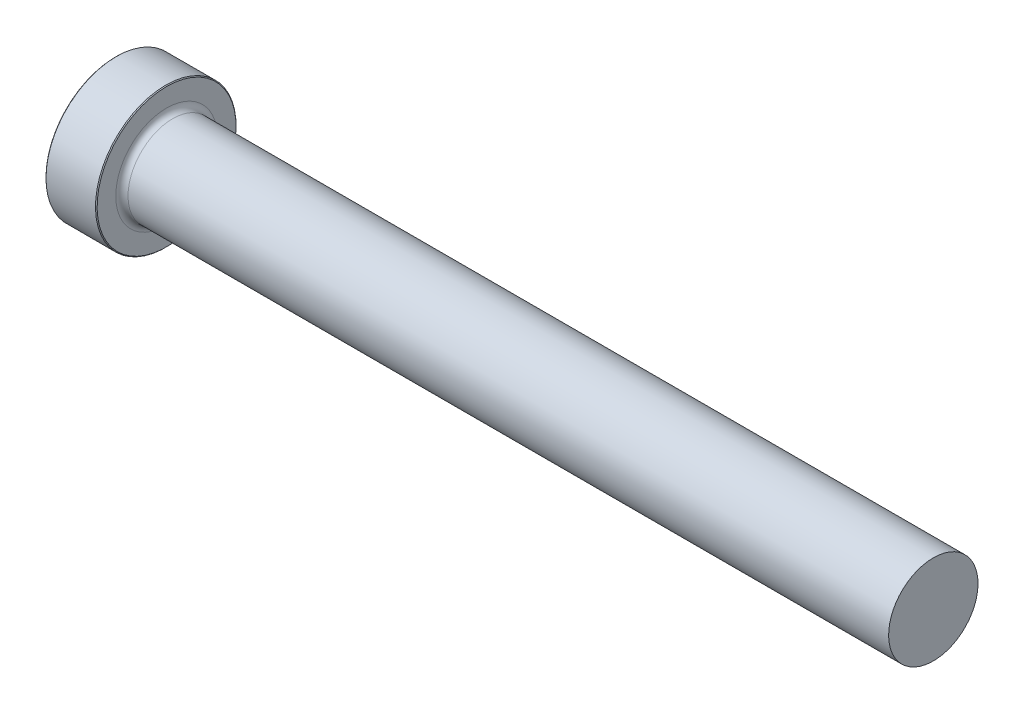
from build123d import *

# Parameters (mm, degrees)
CHAMFER1_SIZE = 0.1016


with BuildPart() as part:
    # Sketch1 → Revolve1 (revolve)
    with BuildSketch(Plane.XY):
        with BuildLine():
            Line((0, 0), (0, 8.73125))
            Line((0, 8.73125), (6.35, 8.73125))
            Line((6.35, 8.73125), (6.35, 6.31444))
            ThreePointArc((6.35, 6.31444), (6.573184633, 5.775624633), (7.112, 5.55244))
            Line((7.112, 5.55244), (101.6, 5.55244))
            Line((101.6, 5.55244), (101.6, 0))
            Line((101.6, 0), (0, 0))
        make_face()
    revolve(axis=Axis((101.6, 0, 0), (-1, 0, 0)))

    # Chamfer1
    chamfer1_edges = [part.edges().sort_by_distance(p)[0] for p in [
        (0, -8.73125, 0),
        (6.35, -8.73125, 0),
    ]]
    chamfer(chamfer1_edges, length=CHAMFER1_SIZE)


solid = part.part
